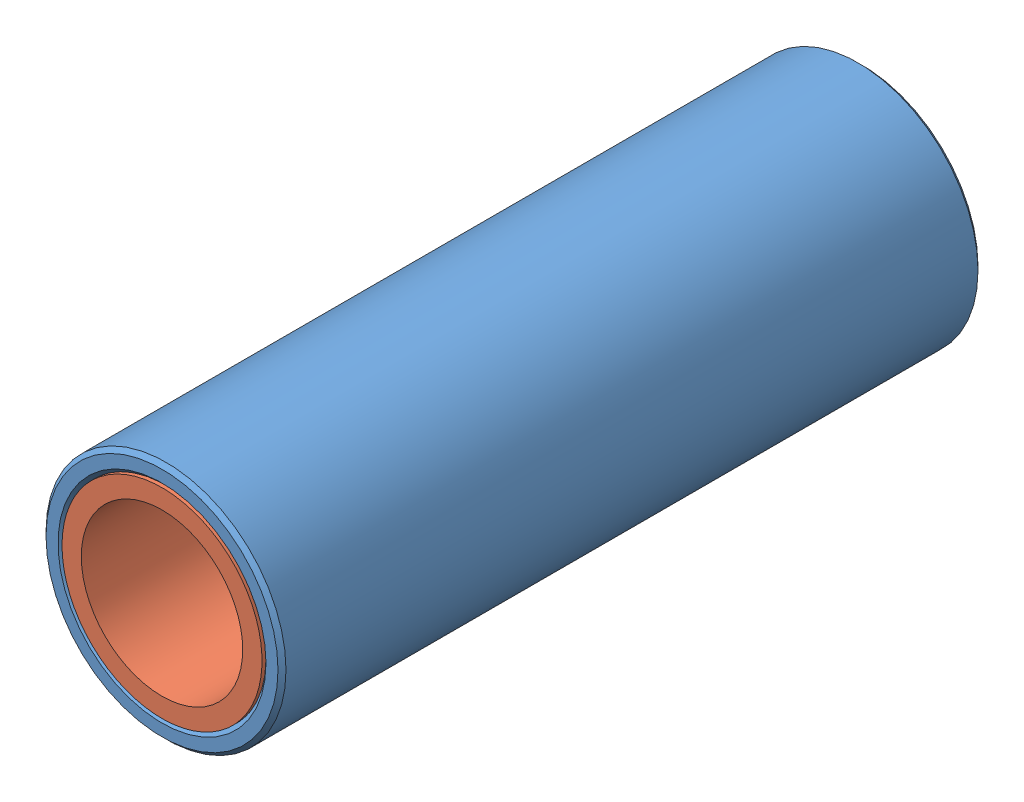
SolidWorks assembly UlTi_v1.1 - 01.13 ULB8LUU.SLDASM, configuration По умолчанию (file format 11000). Lengths in mm.
Overall size (12 12 35).
3 component instances, 2 part files, 4 mates.
Components (placement in the parent):
- UlTi_v1.1 - 01.13.01 ULB8LUU case-1: UlTi_v1.1 - 01.13.01 ULB8LUU case.SLDPRT [По умолчанию] at (-27.4213 2.7618 -17.5) size (12 12 35)
- UlTi_v1.1 - 01.13.02 ULB8LUU bushing-1: UlTi_v1.1 - 01.13.02 ULB8LUU bushing.SLDPRT [По умолчанию] at (-27.4213 2.7618 7.5) size (10 10 10)
- UlTi_v1.1 - 01.13.02 ULB8LUU bushing-2: UlTi_v1.1 - 01.13.02 ULB8LUU bushing.SLDPRT [По умолчанию] at (-27.4213 2.7618 -17.5) size (10 10 10)
Mates (geometry in assembly coordinates):
- Концентричный1: concentric: cylinder of ? through (-27.4213 2.7618 17.5) axis (0 0 -1) radius 5; cylinder of UlTi_v1.1 - 01.13.02 ULB8LUU bushing-1 through (-27.4213 2.7618 17.5) axis (0 0 -1) radius 5
- Концентричный2: concentric: cylinder of ? through (-27.4213 2.7618 17.5) axis (0 0 -1) radius 5; cylinder of ? through (-27.4213 2.7618 -7.5) axis (0 0 -1) radius 5
- Совпадение1: coincident: plane of ? through (-27.4213 2.7618 17.5) normal (0 0 1); plane of UlTi_v1.1 - 01.13.02 ULB8LUU bushing-1 through (-27.4213 2.7618 17.5) normal (0 0 1)
- Совпадение2: coincident: plane of ? through (-27.4213 2.7618 -17.5) normal (0 0 -1); plane of ? through (-27.4213 2.7618 -17.5) normal (0 0 -1)
